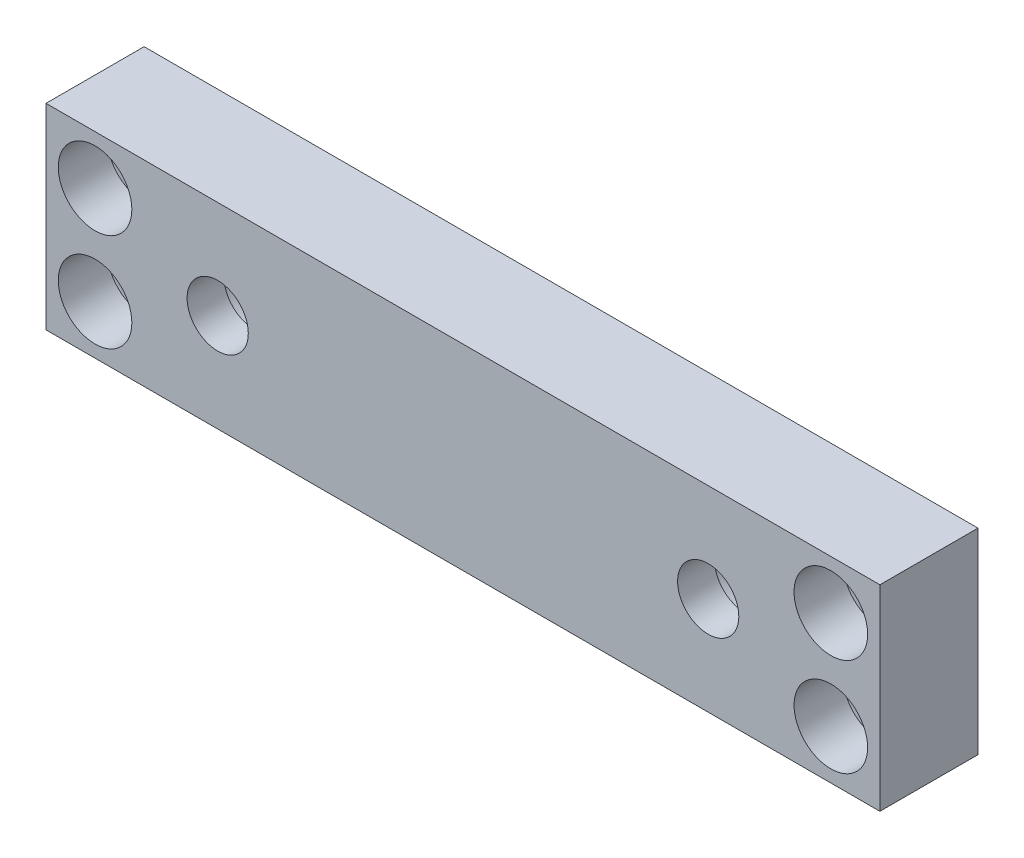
ISO-10303-21;
HEADER;
FILE_DESCRIPTION(('STEP AP214'),'2;1');
FILE_NAME('part.step','',(''),(''),'','','');
FILE_SCHEMA(('AUTOMOTIVE_DESIGN { 1 0 10303 214 1 1 1 1 }'));
ENDSEC;
DATA;
#1=APPLICATION_CONTEXT('core data for automotive mechanical design processes');
#2=APPLICATION_PROTOCOL_DEFINITION('international standard','automotive_design',2000,#1);
#3=PRODUCT_CONTEXT('',#1,'mechanical');
#4=PRODUCT('Part','Part','',(#3));
#5=PRODUCT_RELATED_PRODUCT_CATEGORY('part','',(#4));
#6=PRODUCT_DEFINITION_FORMATION('','',#4);
#7=PRODUCT_DEFINITION_CONTEXT('part definition',#1,'design');
#8=PRODUCT_DEFINITION('design','',#6,#7);
#9=PRODUCT_DEFINITION_SHAPE('','',#8);
#10=(LENGTH_UNIT() NAMED_UNIT(*) SI_UNIT(.MILLI.,.METRE.));
#11=(NAMED_UNIT(*) PLANE_ANGLE_UNIT() SI_UNIT($,.RADIAN.));
#12=(NAMED_UNIT(*) SI_UNIT($,.STERADIAN.) SOLID_ANGLE_UNIT());
#13=UNCERTAINTY_MEASURE_WITH_UNIT(LENGTH_MEASURE(1.E-05),#10,'distance_accuracy_value','');
#14=(GEOMETRIC_REPRESENTATION_CONTEXT(3) GLOBAL_UNCERTAINTY_ASSIGNED_CONTEXT((#13)) GLOBAL_UNIT_ASSIGNED_CONTEXT((#10,
#11,#12)) REPRESENTATION_CONTEXT('',''));
#15=CARTESIAN_POINT('',(0.,0.,0.));
#16=DIRECTION('',(0.,0.,1.));
#17=DIRECTION('',(1.,0.,0.));
#18=AXIS2_PLACEMENT_3D('',#15,#16,#17);
#19=CARTESIAN_POINT('',(0.,0.,12.7));
#20=DIRECTION('',(0.,0.,1.));
#21=DIRECTION('',(1.,0.,0.));
#22=AXIS2_PLACEMENT_3D('',#19,#20,#21);
#23=PLANE('',#22);
#24=CARTESIAN_POINT('',(47.625,-6.35,12.7));
#25=DIRECTION('',(0.,0.,1.));
#26=DIRECTION('',(1.,0.,0.));
#27=AXIS2_PLACEMENT_3D('',#24,#25,#26);
#28=CIRCLE('',#27,4.7625);
#29=CARTESIAN_POINT('',(52.3875,-6.35,12.7));
#30=VERTEX_POINT('',#29);
#31=EDGE_CURVE('E136',#30,#30,#28,.F.);
#32=ORIENTED_EDGE('',*,*,#31,.T.);
#33=EDGE_LOOP('',(#32));
#34=FACE_BOUND('',#33,.T.);
#35=CARTESIAN_POINT('',(-47.625,-6.35,12.7));
#36=DIRECTION('',(0.,0.,1.));
#37=DIRECTION('',(1.,0.,0.));
#38=AXIS2_PLACEMENT_3D('',#35,#36,#37);
#39=CIRCLE('',#38,4.7625);
#40=CARTESIAN_POINT('',(-42.8625,-6.35,12.7));
#41=VERTEX_POINT('',#40);
#42=EDGE_CURVE('E121',#41,#41,#39,.F.);
#43=ORIENTED_EDGE('',*,*,#42,.T.);
#44=EDGE_LOOP('',(#43));
#45=FACE_BOUND('',#44,.T.);
#46=CARTESIAN_POINT('',(-31.75,0.,12.7));
#47=DIRECTION('',(0.,0.,1.));
#48=DIRECTION('',(1.,0.,0.));
#49=AXIS2_PLACEMENT_3D('',#46,#47,#48);
#50=CIRCLE('',#49,3.9624);
#51=CARTESIAN_POINT('',(-27.7876,0.,12.7));
#52=VERTEX_POINT('',#51);
#53=EDGE_CURVE('E102',#52,#52,#50,.T.);
#54=ORIENTED_EDGE('',*,*,#53,.F.);
#55=EDGE_LOOP('',(#54));
#56=FACE_BOUND('',#55,.T.);
#57=DIRECTION('',(0.,-1.,0.));
#58=VECTOR('',#57,1.);
#59=CARTESIAN_POINT('',(-53.975,12.7,12.7));
#60=LINE('',#59,#58);
#61=CARTESIAN_POINT('',(-53.975,12.7,12.7));
#62=VERTEX_POINT('',#61);
#63=CARTESIAN_POINT('',(-53.975,-12.7,12.7));
#64=VERTEX_POINT('',#63);
#65=EDGE_CURVE('E86',#62,#64,#60,.T.);
#66=ORIENTED_EDGE('',*,*,#65,.T.);
#67=DIRECTION('',(1.,0.,0.));
#68=VECTOR('',#67,1.);
#69=CARTESIAN_POINT('',(-53.975,-12.7,12.7));
#70=LINE('',#69,#68);
#71=CARTESIAN_POINT('',(53.975,-12.7,12.7));
#72=VERTEX_POINT('',#71);
#73=EDGE_CURVE('E81',#64,#72,#70,.T.);
#74=ORIENTED_EDGE('',*,*,#73,.T.);
#75=DIRECTION('',(0.,1.,0.));
#76=VECTOR('',#75,1.);
#77=CARTESIAN_POINT('',(53.975,-12.7,12.7));
#78=LINE('',#77,#76);
#79=CARTESIAN_POINT('',(53.975,12.7,12.7));
#80=VERTEX_POINT('',#79);
#81=EDGE_CURVE('E84',#72,#80,#78,.T.);
#82=ORIENTED_EDGE('',*,*,#81,.T.);
#83=DIRECTION('',(-1.,0.,0.));
#84=VECTOR('',#83,1.);
#85=CARTESIAN_POINT('',(53.975,12.7,12.7));
#86=LINE('',#85,#84);
#87=EDGE_CURVE('E51',#80,#62,#86,.T.);
#88=ORIENTED_EDGE('',*,*,#87,.T.);
#89=EDGE_LOOP('',(#66,#74,#82,#88));
#90=FACE_BOUND('',#89,.T.);
#91=CARTESIAN_POINT('',(31.75,0.,12.7));
#92=DIRECTION('',(0.,0.,1.));
#93=DIRECTION('',(1.,0.,0.));
#94=AXIS2_PLACEMENT_3D('',#91,#92,#93);
#95=CIRCLE('',#94,3.9624);
#96=CARTESIAN_POINT('',(35.7124,0.,12.7));
#97=VERTEX_POINT('',#96);
#98=EDGE_CURVE('E169',#97,#97,#95,.T.);
#99=ORIENTED_EDGE('',*,*,#98,.F.);
#100=EDGE_LOOP('',(#99));
#101=FACE_BOUND('',#100,.T.);
#102=CARTESIAN_POINT('',(-47.625,6.35,12.7));
#103=DIRECTION('',(0.,0.,1.));
#104=DIRECTION('',(1.,0.,0.));
#105=AXIS2_PLACEMENT_3D('',#102,#103,#104);
#106=CIRCLE('',#105,4.7625);
#107=CARTESIAN_POINT('',(-42.8625,6.35,12.7));
#108=VERTEX_POINT('',#107);
#109=EDGE_CURVE('E129',#108,#108,#106,.F.);
#110=ORIENTED_EDGE('',*,*,#109,.T.);
#111=EDGE_LOOP('',(#110));
#112=FACE_BOUND('',#111,.T.);
#113=CARTESIAN_POINT('',(47.625,6.35,12.7));
#114=DIRECTION('',(0.,0.,1.));
#115=DIRECTION('',(1.,0.,0.));
#116=AXIS2_PLACEMENT_3D('',#113,#114,#115);
#117=CIRCLE('',#116,4.7625);
#118=CARTESIAN_POINT('',(52.3875,6.35,12.7));
#119=VERTEX_POINT('',#118);
#120=EDGE_CURVE('E36',#119,#119,#117,.F.);
#121=ORIENTED_EDGE('',*,*,#120,.T.);
#122=EDGE_LOOP('',(#121));
#123=FACE_BOUND('',#122,.T.);
#124=ADVANCED_FACE('F32',(#34,#45,#56,#90,#101,#112,#123),#23,.T.);
#125=CARTESIAN_POINT('',(47.625,6.35,12.7));
#126=DIRECTION('',(0.,0.,-1.));
#127=DIRECTION('',(-1.,0.,0.));
#128=AXIS2_PLACEMENT_3D('',#125,#126,#127);
#129=CYLINDRICAL_SURFACE('',#128,3.175);
#130=CARTESIAN_POINT('',(47.625,6.35,0.));
#131=DIRECTION('',(0.,0.,1.));
#132=DIRECTION('',(1.,0.,0.));
#133=AXIS2_PLACEMENT_3D('',#130,#131,#132);
#134=CIRCLE('',#133,3.175);
#135=CARTESIAN_POINT('',(50.8,6.35,0.));
#136=VERTEX_POINT('',#135);
#137=EDGE_CURVE('E166',#136,#136,#134,.T.);
#138=ORIENTED_EDGE('',*,*,#137,.F.);
#139=EDGE_LOOP('',(#138));
#140=FACE_BOUND('',#139,.T.);
#141=CARTESIAN_POINT('',(47.625,6.35,6.35));
#142=DIRECTION('',(0.,0.,1.));
#143=DIRECTION('',(1.,0.,0.));
#144=AXIS2_PLACEMENT_3D('',#141,#142,#143);
#145=CIRCLE('',#144,3.175);
#146=CARTESIAN_POINT('',(50.8,6.35,6.35));
#147=VERTEX_POINT('',#146);
#148=EDGE_CURVE('E139',#147,#147,#145,.T.);
#149=ORIENTED_EDGE('',*,*,#148,.T.);
#150=EDGE_LOOP('',(#149));
#151=FACE_BOUND('',#150,.T.);
#152=ADVANCED_FACE('F184',(#140,#151),#129,.F.);
#153=CARTESIAN_POINT('',(47.625,-6.35,12.7));
#154=DIRECTION('',(0.,0.,-1.));
#155=DIRECTION('',(-1.,0.,0.));
#156=AXIS2_PLACEMENT_3D('',#153,#154,#155);
#157=CYLINDRICAL_SURFACE('',#156,3.175);
#158=CARTESIAN_POINT('',(47.625,-6.35,0.));
#159=DIRECTION('',(0.,0.,1.));
#160=DIRECTION('',(1.,0.,0.));
#161=AXIS2_PLACEMENT_3D('',#158,#159,#160);
#162=CIRCLE('',#161,3.175);
#163=CARTESIAN_POINT('',(50.8,-6.35,0.));
#164=VERTEX_POINT('',#163);
#165=EDGE_CURVE('E111',#164,#164,#162,.T.);
#166=ORIENTED_EDGE('',*,*,#165,.F.);
#167=EDGE_LOOP('',(#166));
#168=FACE_BOUND('',#167,.T.);
#169=CARTESIAN_POINT('',(47.625,-6.35,6.35));
#170=DIRECTION('',(0.,0.,1.));
#171=DIRECTION('',(1.,0.,0.));
#172=AXIS2_PLACEMENT_3D('',#169,#170,#171);
#173=CIRCLE('',#172,3.175);
#174=CARTESIAN_POINT('',(50.8,-6.35,6.35));
#175=VERTEX_POINT('',#174);
#176=EDGE_CURVE('E133',#175,#175,#173,.T.);
#177=ORIENTED_EDGE('',*,*,#176,.T.);
#178=EDGE_LOOP('',(#177));
#179=FACE_BOUND('',#178,.T.);
#180=ADVANCED_FACE('F190',(#168,#179),#157,.F.);
#181=CARTESIAN_POINT('',(-47.625,6.35,12.7));
#182=DIRECTION('',(0.,0.,-1.));
#183=DIRECTION('',(-1.,0.,0.));
#184=AXIS2_PLACEMENT_3D('',#181,#182,#183);
#185=CYLINDRICAL_SURFACE('',#184,3.175);
#186=CARTESIAN_POINT('',(-47.625,6.35,0.));
#187=DIRECTION('',(0.,0.,1.));
#188=DIRECTION('',(1.,0.,0.));
#189=AXIS2_PLACEMENT_3D('',#186,#187,#188);
#190=CIRCLE('',#189,3.175);
#191=CARTESIAN_POINT('',(-44.45,6.35,0.));
#192=VERTEX_POINT('',#191);
#193=EDGE_CURVE('E172',#192,#192,#190,.T.);
#194=ORIENTED_EDGE('',*,*,#193,.F.);
#195=EDGE_LOOP('',(#194));
#196=FACE_BOUND('',#195,.T.);
#197=CARTESIAN_POINT('',(-47.625,6.35,6.35));
#198=DIRECTION('',(0.,0.,1.));
#199=DIRECTION('',(1.,0.,0.));
#200=AXIS2_PLACEMENT_3D('',#197,#198,#199);
#201=CIRCLE('',#200,3.175);
#202=CARTESIAN_POINT('',(-44.45,6.35,6.35));
#203=VERTEX_POINT('',#202);
#204=EDGE_CURVE('E126',#203,#203,#201,.T.);
#205=ORIENTED_EDGE('',*,*,#204,.T.);
#206=EDGE_LOOP('',(#205));
#207=FACE_BOUND('',#206,.T.);
#208=ADVANCED_FACE('F245',(#196,#207),#185,.F.);
#209=CARTESIAN_POINT('',(-47.625,-6.35,12.7));
#210=DIRECTION('',(0.,0.,-1.));
#211=DIRECTION('',(-1.,0.,0.));
#212=AXIS2_PLACEMENT_3D('',#209,#210,#211);
#213=CYLINDRICAL_SURFACE('',#212,3.175);
#214=CARTESIAN_POINT('',(-47.625,-6.35,0.));
#215=DIRECTION('',(0.,0.,1.));
#216=DIRECTION('',(1.,0.,0.));
#217=AXIS2_PLACEMENT_3D('',#214,#215,#216);
#218=CIRCLE('',#217,3.175);
#219=CARTESIAN_POINT('',(-44.45,-6.35,0.));
#220=VERTEX_POINT('',#219);
#221=EDGE_CURVE('E175',#220,#220,#218,.T.);
#222=ORIENTED_EDGE('',*,*,#221,.F.);
#223=EDGE_LOOP('',(#222));
#224=FACE_BOUND('',#223,.T.);
#225=CARTESIAN_POINT('',(-47.625,-6.35,6.35));
#226=DIRECTION('',(0.,0.,1.));
#227=DIRECTION('',(1.,0.,0.));
#228=AXIS2_PLACEMENT_3D('',#225,#226,#227);
#229=CIRCLE('',#228,3.175);
#230=CARTESIAN_POINT('',(-44.45,-6.35,6.35));
#231=VERTEX_POINT('',#230);
#232=EDGE_CURVE('E118',#231,#231,#229,.T.);
#233=ORIENTED_EDGE('',*,*,#232,.T.);
#234=EDGE_LOOP('',(#233));
#235=FACE_BOUND('',#234,.T.);
#236=ADVANCED_FACE('F200',(#224,#235),#213,.F.);
#237=CARTESIAN_POINT('',(0.,0.,0.));
#238=DIRECTION('',(0.,0.,1.));
#239=DIRECTION('',(1.,0.,0.));
#240=AXIS2_PLACEMENT_3D('',#237,#238,#239);
#241=PLANE('',#240);
#242=CARTESIAN_POINT('',(31.75,0.,0.));
#243=DIRECTION('',(0.,0.,1.));
#244=DIRECTION('',(1.,0.,0.));
#245=AXIS2_PLACEMENT_3D('',#242,#243,#244);
#246=CIRCLE('',#245,6.);
#247=CARTESIAN_POINT('',(37.75,0.,0.));
#248=VERTEX_POINT('',#247);
#249=EDGE_CURVE('E116',#248,#248,#246,.T.);
#250=ORIENTED_EDGE('',*,*,#249,.T.);
#251=EDGE_LOOP('',(#250));
#252=FACE_BOUND('',#251,.T.);
#253=ORIENTED_EDGE('',*,*,#137,.T.);
#254=EDGE_LOOP('',(#253));
#255=FACE_BOUND('',#254,.T.);
#256=ORIENTED_EDGE('',*,*,#193,.T.);
#257=EDGE_LOOP('',(#256));
#258=FACE_BOUND('',#257,.T.);
#259=DIRECTION('',(0.,-1.,0.));
#260=VECTOR('',#259,1.);
#261=CARTESIAN_POINT('',(-53.975,12.7,0.));
#262=LINE('',#261,#260);
#263=CARTESIAN_POINT('',(-53.975,12.7,0.));
#264=VERTEX_POINT('',#263);
#265=CARTESIAN_POINT('',(-53.975,-12.7,0.));
#266=VERTEX_POINT('',#265);
#267=EDGE_CURVE('E99',#264,#266,#262,.T.);
#268=ORIENTED_EDGE('',*,*,#267,.F.);
#269=DIRECTION('',(-1.,0.,0.));
#270=VECTOR('',#269,1.);
#271=CARTESIAN_POINT('',(53.975,12.7,0.));
#272=LINE('',#271,#270);
#273=CARTESIAN_POINT('',(53.975,12.7,0.));
#274=VERTEX_POINT('',#273);
#275=EDGE_CURVE('E74',#274,#264,#272,.T.);
#276=ORIENTED_EDGE('',*,*,#275,.F.);
#277=DIRECTION('',(0.,1.,0.));
#278=VECTOR('',#277,1.);
#279=CARTESIAN_POINT('',(53.975,-12.7,0.));
#280=LINE('',#279,#278);
#281=CARTESIAN_POINT('',(53.975,-12.7,0.));
#282=VERTEX_POINT('',#281);
#283=EDGE_CURVE('E68',#282,#274,#280,.T.);
#284=ORIENTED_EDGE('',*,*,#283,.F.);
#285=DIRECTION('',(1.,0.,0.));
#286=VECTOR('',#285,1.);
#287=CARTESIAN_POINT('',(-53.975,-12.7,0.));
#288=LINE('',#287,#286);
#289=EDGE_CURVE('E90',#266,#282,#288,.T.);
#290=ORIENTED_EDGE('',*,*,#289,.F.);
#291=EDGE_LOOP('',(#268,#276,#284,#290));
#292=FACE_BOUND('',#291,.T.);
#293=ORIENTED_EDGE('',*,*,#221,.T.);
#294=EDGE_LOOP('',(#293));
#295=FACE_BOUND('',#294,.T.);
#296=ORIENTED_EDGE('',*,*,#165,.T.);
#297=EDGE_LOOP('',(#296));
#298=FACE_BOUND('',#297,.T.);
#299=CARTESIAN_POINT('',(-31.75,0.,0.));
#300=DIRECTION('',(0.,0.,1.));
#301=DIRECTION('',(1.,0.,0.));
#302=AXIS2_PLACEMENT_3D('',#299,#300,#301);
#303=CIRCLE('',#302,6.);
#304=CARTESIAN_POINT('',(-25.75,0.,0.));
#305=VERTEX_POINT('',#304);
#306=EDGE_CURVE('E125',#305,#305,#303,.T.);
#307=ORIENTED_EDGE('',*,*,#306,.T.);
#308=EDGE_LOOP('',(#307));
#309=FACE_BOUND('',#308,.T.);
#310=ADVANCED_FACE('F197',(#252,#255,#258,#292,#295,#298,#309),#241,.F.);
#311=CARTESIAN_POINT('',(-53.975,12.7,12.7));
#312=DIRECTION('',(1.,0.,0.));
#313=DIRECTION('',(0.,0.,-1.));
#314=AXIS2_PLACEMENT_3D('',#311,#312,#313);
#315=PLANE('',#314);
#316=ORIENTED_EDGE('',*,*,#267,.T.);
#317=DIRECTION('',(0.,0.,-1.));
#318=VECTOR('',#317,1.);
#319=CARTESIAN_POINT('',(-53.975,-12.7,12.7));
#320=LINE('',#319,#318);
#321=EDGE_CURVE('E11',#64,#266,#320,.T.);
#322=ORIENTED_EDGE('',*,*,#321,.F.);
#323=ORIENTED_EDGE('',*,*,#65,.F.);
#324=DIRECTION('',(0.,0.,-1.));
#325=VECTOR('',#324,1.);
#326=CARTESIAN_POINT('',(-53.975,12.7,12.7));
#327=LINE('',#326,#325);
#328=EDGE_CURVE('E95',#62,#264,#327,.T.);
#329=ORIENTED_EDGE('',*,*,#328,.T.);
#330=EDGE_LOOP('',(#316,#322,#323,#329));
#331=FACE_BOUND('',#330,.T.);
#332=ADVANCED_FACE('F34',(#331),#315,.F.);
#333=CARTESIAN_POINT('',(-53.975,-12.7,12.7));
#334=DIRECTION('',(0.,1.,0.));
#335=DIRECTION('',(0.,0.,1.));
#336=AXIS2_PLACEMENT_3D('',#333,#334,#335);
#337=PLANE('',#336);
#338=ORIENTED_EDGE('',*,*,#289,.T.);
#339=DIRECTION('',(0.,0.,-1.));
#340=VECTOR('',#339,1.);
#341=CARTESIAN_POINT('',(53.975,-12.7,12.7));
#342=LINE('',#341,#340);
#343=EDGE_CURVE('E42',#72,#282,#342,.T.);
#344=ORIENTED_EDGE('',*,*,#343,.F.);
#345=ORIENTED_EDGE('',*,*,#73,.F.);
#346=ORIENTED_EDGE('',*,*,#321,.T.);
#347=EDGE_LOOP('',(#338,#344,#345,#346));
#348=FACE_BOUND('',#347,.T.);
#349=ADVANCED_FACE('F89',(#348),#337,.F.);
#350=CARTESIAN_POINT('',(53.975,-12.7,12.7));
#351=DIRECTION('',(-1.,0.,0.));
#352=DIRECTION('',(0.,0.,1.));
#353=AXIS2_PLACEMENT_3D('',#350,#351,#352);
#354=PLANE('',#353);
#355=ORIENTED_EDGE('',*,*,#283,.T.);
#356=DIRECTION('',(0.,0.,-1.));
#357=VECTOR('',#356,1.);
#358=CARTESIAN_POINT('',(53.975,12.7,12.7));
#359=LINE('',#358,#357);
#360=EDGE_CURVE('E91',#80,#274,#359,.T.);
#361=ORIENTED_EDGE('',*,*,#360,.F.);
#362=ORIENTED_EDGE('',*,*,#81,.F.);
#363=ORIENTED_EDGE('',*,*,#343,.T.);
#364=EDGE_LOOP('',(#355,#361,#362,#363));
#365=FACE_BOUND('',#364,.T.);
#366=ADVANCED_FACE('F93',(#365),#354,.F.);
#367=CARTESIAN_POINT('',(53.975,12.7,12.7));
#368=DIRECTION('',(0.,-1.,0.));
#369=DIRECTION('',(0.,0.,-1.));
#370=AXIS2_PLACEMENT_3D('',#367,#368,#369);
#371=PLANE('',#370);
#372=ORIENTED_EDGE('',*,*,#275,.T.);
#373=ORIENTED_EDGE('',*,*,#328,.F.);
#374=ORIENTED_EDGE('',*,*,#87,.F.);
#375=ORIENTED_EDGE('',*,*,#360,.T.);
#376=EDGE_LOOP('',(#372,#373,#374,#375));
#377=FACE_BOUND('',#376,.T.);
#378=ADVANCED_FACE('F202',(#377),#371,.F.);
#379=CARTESIAN_POINT('',(-31.75,0.,12.7));
#380=DIRECTION('',(0.,0.,-1.));
#381=DIRECTION('',(-1.,0.,0.));
#382=AXIS2_PLACEMENT_3D('',#379,#380,#381);
#383=CYLINDRICAL_SURFACE('',#382,3.9624);
#384=CARTESIAN_POINT('',(-31.75,0.,7.9248));
#385=DIRECTION('',(0.,0.,1.));
#386=DIRECTION('',(1.,0.,0.));
#387=AXIS2_PLACEMENT_3D('',#384,#385,#386);
#388=CIRCLE('',#387,3.9624);
#389=CARTESIAN_POINT('',(-27.7876,0.,7.9248));
#390=VERTEX_POINT('',#389);
#391=EDGE_CURVE('E113',#390,#390,#388,.T.);
#392=ORIENTED_EDGE('',*,*,#391,.F.);
#393=EDGE_LOOP('',(#392));
#394=FACE_BOUND('',#393,.T.);
#395=ORIENTED_EDGE('',*,*,#53,.T.);
#396=EDGE_LOOP('',(#395));
#397=FACE_BOUND('',#396,.T.);
#398=ADVANCED_FACE('F181',(#394,#397),#383,.F.);
#399=CARTESIAN_POINT('',(31.75,0.,12.7));
#400=DIRECTION('',(0.,0.,-1.));
#401=DIRECTION('',(-1.,0.,0.));
#402=AXIS2_PLACEMENT_3D('',#399,#400,#401);
#403=CYLINDRICAL_SURFACE('',#402,3.9624);
#404=CARTESIAN_POINT('',(31.75,0.,7.9248));
#405=DIRECTION('',(0.,0.,1.));
#406=DIRECTION('',(1.,0.,0.));
#407=AXIS2_PLACEMENT_3D('',#404,#405,#406);
#408=CIRCLE('',#407,3.9624);
#409=CARTESIAN_POINT('',(35.7124,0.,7.9248));
#410=VERTEX_POINT('',#409);
#411=EDGE_CURVE('E108',#410,#410,#408,.T.);
#412=ORIENTED_EDGE('',*,*,#411,.F.);
#413=EDGE_LOOP('',(#412));
#414=FACE_BOUND('',#413,.T.);
#415=ORIENTED_EDGE('',*,*,#98,.T.);
#416=EDGE_LOOP('',(#415));
#417=FACE_BOUND('',#416,.T.);
#418=ADVANCED_FACE('F242',(#414,#417),#403,.F.);
#419=CARTESIAN_POINT('',(31.75,0.,7.9248));
#420=DIRECTION('',(0.,0.,-1.));
#421=DIRECTION('',(-1.,0.,0.));
#422=AXIS2_PLACEMENT_3D('',#419,#420,#421);
#423=CYLINDRICAL_SURFACE('',#422,6.);
#424=CARTESIAN_POINT('',(31.75,0.,7.9248));
#425=DIRECTION('',(0.,0.,1.));
#426=DIRECTION('',(1.,0.,0.));
#427=AXIS2_PLACEMENT_3D('',#424,#425,#426);
#428=CIRCLE('',#427,6.);
#429=CARTESIAN_POINT('',(37.75,0.,7.9248));
#430=VERTEX_POINT('',#429);
#431=EDGE_CURVE('E112',#430,#430,#428,.T.);
#432=ORIENTED_EDGE('',*,*,#431,.T.);
#433=EDGE_LOOP('',(#432));
#434=FACE_BOUND('',#433,.T.);
#435=ORIENTED_EDGE('',*,*,#249,.F.);
#436=EDGE_LOOP('',(#435));
#437=FACE_BOUND('',#436,.T.);
#438=ADVANCED_FACE('F235',(#434,#437),#423,.F.);
#439=CARTESIAN_POINT('',(31.75,0.,7.9248));
#440=DIRECTION('',(0.,0.,1.));
#441=DIRECTION('',(1.,0.,0.));
#442=AXIS2_PLACEMENT_3D('',#439,#440,#441);
#443=PLANE('',#442);
#444=ORIENTED_EDGE('',*,*,#411,.T.);
#445=EDGE_LOOP('',(#444));
#446=FACE_BOUND('',#445,.T.);
#447=ORIENTED_EDGE('',*,*,#431,.F.);
#448=EDGE_LOOP('',(#447));
#449=FACE_BOUND('',#448,.T.);
#450=ADVANCED_FACE('F225',(#446,#449),#443,.F.);
#451=CARTESIAN_POINT('',(-31.75,0.,7.9248));
#452=DIRECTION('',(0.,0.,-1.));
#453=DIRECTION('',(-1.,0.,0.));
#454=AXIS2_PLACEMENT_3D('',#451,#452,#453);
#455=CYLINDRICAL_SURFACE('',#454,6.);
#456=CARTESIAN_POINT('',(-31.75,0.,7.9248));
#457=DIRECTION('',(0.,0.,1.));
#458=DIRECTION('',(1.,0.,0.));
#459=AXIS2_PLACEMENT_3D('',#456,#457,#458);
#460=CIRCLE('',#459,6.);
#461=CARTESIAN_POINT('',(-25.75,0.,7.9248));
#462=VERTEX_POINT('',#461);
#463=EDGE_CURVE('E117',#462,#462,#460,.T.);
#464=ORIENTED_EDGE('',*,*,#463,.T.);
#465=EDGE_LOOP('',(#464));
#466=FACE_BOUND('',#465,.T.);
#467=ORIENTED_EDGE('',*,*,#306,.F.);
#468=EDGE_LOOP('',(#467));
#469=FACE_BOUND('',#468,.T.);
#470=ADVANCED_FACE('F222',(#466,#469),#455,.F.);
#471=CARTESIAN_POINT('',(-31.75,0.,7.9248));
#472=DIRECTION('',(0.,0.,1.));
#473=DIRECTION('',(1.,0.,0.));
#474=AXIS2_PLACEMENT_3D('',#471,#472,#473);
#475=PLANE('',#474);
#476=ORIENTED_EDGE('',*,*,#391,.T.);
#477=EDGE_LOOP('',(#476));
#478=FACE_BOUND('',#477,.T.);
#479=ORIENTED_EDGE('',*,*,#463,.F.);
#480=EDGE_LOOP('',(#479));
#481=FACE_BOUND('',#480,.T.);
#482=ADVANCED_FACE('F224',(#478,#481),#475,.F.);
#483=CARTESIAN_POINT('',(-47.625,-6.35,31.75));
#484=DIRECTION('',(0.,0.,-1.));
#485=DIRECTION('',(-1.,0.,0.));
#486=AXIS2_PLACEMENT_3D('',#483,#484,#485);
#487=CYLINDRICAL_SURFACE('',#486,4.7625);
#488=ORIENTED_EDGE('',*,*,#42,.F.);
#489=EDGE_LOOP('',(#488));
#490=FACE_BOUND('',#489,.T.);
#491=CARTESIAN_POINT('',(-47.625,-6.35,6.35));
#492=DIRECTION('',(0.,0.,1.));
#493=DIRECTION('',(1.,0.,0.));
#494=AXIS2_PLACEMENT_3D('',#491,#492,#493);
#495=CIRCLE('',#494,4.7625);
#496=CARTESIAN_POINT('',(-42.8625,-6.35,6.35));
#497=VERTEX_POINT('',#496);
#498=EDGE_CURVE('E122',#497,#497,#495,.T.);
#499=ORIENTED_EDGE('',*,*,#498,.F.);
#500=EDGE_LOOP('',(#499));
#501=FACE_BOUND('',#500,.T.);
#502=ADVANCED_FACE('F232',(#490,#501),#487,.F.);
#503=CARTESIAN_POINT('',(-47.625,-6.35,6.35));
#504=DIRECTION('',(0.,0.,1.));
#505=DIRECTION('',(1.,0.,0.));
#506=AXIS2_PLACEMENT_3D('',#503,#504,#505);
#507=PLANE('',#506);
#508=ORIENTED_EDGE('',*,*,#232,.F.);
#509=EDGE_LOOP('',(#508));
#510=FACE_BOUND('',#509,.T.);
#511=ORIENTED_EDGE('',*,*,#498,.T.);
#512=EDGE_LOOP('',(#511));
#513=FACE_BOUND('',#512,.T.);
#514=ADVANCED_FACE('F260',(#510,#513),#507,.T.);
#515=CARTESIAN_POINT('',(-47.625,6.35,31.75));
#516=DIRECTION('',(0.,0.,-1.));
#517=DIRECTION('',(-1.,0.,0.));
#518=AXIS2_PLACEMENT_3D('',#515,#516,#517);
#519=CYLINDRICAL_SURFACE('',#518,4.7625);
#520=ORIENTED_EDGE('',*,*,#109,.F.);
#521=EDGE_LOOP('',(#520));
#522=FACE_BOUND('',#521,.T.);
#523=CARTESIAN_POINT('',(-47.625,6.35,6.35));
#524=DIRECTION('',(0.,0.,1.));
#525=DIRECTION('',(1.,0.,0.));
#526=AXIS2_PLACEMENT_3D('',#523,#524,#525);
#527=CIRCLE('',#526,4.7625);
#528=CARTESIAN_POINT('',(-42.8625,6.35,6.35));
#529=VERTEX_POINT('',#528);
#530=EDGE_CURVE('E130',#529,#529,#527,.T.);
#531=ORIENTED_EDGE('',*,*,#530,.F.);
#532=EDGE_LOOP('',(#531));
#533=FACE_BOUND('',#532,.T.);
#534=ADVANCED_FACE('F263',(#522,#533),#519,.F.);
#535=CARTESIAN_POINT('',(-47.625,6.35,6.35));
#536=DIRECTION('',(0.,0.,1.));
#537=DIRECTION('',(1.,0.,0.));
#538=AXIS2_PLACEMENT_3D('',#535,#536,#537);
#539=PLANE('',#538);
#540=ORIENTED_EDGE('',*,*,#204,.F.);
#541=EDGE_LOOP('',(#540));
#542=FACE_BOUND('',#541,.T.);
#543=ORIENTED_EDGE('',*,*,#530,.T.);
#544=EDGE_LOOP('',(#543));
#545=FACE_BOUND('',#544,.T.);
#546=ADVANCED_FACE('F275',(#542,#545),#539,.T.);
#547=CARTESIAN_POINT('',(47.625,-6.35,31.75));
#548=DIRECTION('',(0.,0.,-1.));
#549=DIRECTION('',(-1.,0.,0.));
#550=AXIS2_PLACEMENT_3D('',#547,#548,#549);
#551=CYLINDRICAL_SURFACE('',#550,4.7625);
#552=ORIENTED_EDGE('',*,*,#31,.F.);
#553=EDGE_LOOP('',(#552));
#554=FACE_BOUND('',#553,.T.);
#555=CARTESIAN_POINT('',(47.625,-6.35,6.35));
#556=DIRECTION('',(0.,0.,1.));
#557=DIRECTION('',(1.,0.,0.));
#558=AXIS2_PLACEMENT_3D('',#555,#556,#557);
#559=CIRCLE('',#558,4.7625);
#560=CARTESIAN_POINT('',(52.3875,-6.35,6.35));
#561=VERTEX_POINT('',#560);
#562=EDGE_CURVE('E137',#561,#561,#559,.T.);
#563=ORIENTED_EDGE('',*,*,#562,.F.);
#564=EDGE_LOOP('',(#563));
#565=FACE_BOUND('',#564,.T.);
#566=ADVANCED_FACE('F279',(#554,#565),#551,.F.);
#567=CARTESIAN_POINT('',(47.625,-6.35,6.35));
#568=DIRECTION('',(0.,0.,1.));
#569=DIRECTION('',(1.,0.,0.));
#570=AXIS2_PLACEMENT_3D('',#567,#568,#569);
#571=PLANE('',#570);
#572=ORIENTED_EDGE('',*,*,#176,.F.);
#573=EDGE_LOOP('',(#572));
#574=FACE_BOUND('',#573,.T.);
#575=ORIENTED_EDGE('',*,*,#562,.T.);
#576=EDGE_LOOP('',(#575));
#577=FACE_BOUND('',#576,.T.);
#578=ADVANCED_FACE('F283',(#574,#577),#571,.T.);
#579=CARTESIAN_POINT('',(47.625,6.35,31.75));
#580=DIRECTION('',(0.,0.,-1.));
#581=DIRECTION('',(-1.,0.,0.));
#582=AXIS2_PLACEMENT_3D('',#579,#580,#581);
#583=CYLINDRICAL_SURFACE('',#582,4.7625);
#584=ORIENTED_EDGE('',*,*,#120,.F.);
#585=EDGE_LOOP('',(#584));
#586=FACE_BOUND('',#585,.T.);
#587=CARTESIAN_POINT('',(47.625,6.35,6.35));
#588=DIRECTION('',(0.,0.,1.));
#589=DIRECTION('',(1.,0.,0.));
#590=AXIS2_PLACEMENT_3D('',#587,#588,#589);
#591=CIRCLE('',#590,4.7625);
#592=CARTESIAN_POINT('',(52.3875,6.35,6.35));
#593=VERTEX_POINT('',#592);
#594=EDGE_CURVE('E141',#593,#593,#591,.T.);
#595=ORIENTED_EDGE('',*,*,#594,.F.);
#596=EDGE_LOOP('',(#595));
#597=FACE_BOUND('',#596,.T.);
#598=ADVANCED_FACE('F287',(#586,#597),#583,.F.);
#599=CARTESIAN_POINT('',(47.625,6.35,6.35));
#600=DIRECTION('',(0.,0.,1.));
#601=DIRECTION('',(1.,0.,0.));
#602=AXIS2_PLACEMENT_3D('',#599,#600,#601);
#603=PLANE('',#602);
#604=ORIENTED_EDGE('',*,*,#148,.F.);
#605=EDGE_LOOP('',(#604));
#606=FACE_BOUND('',#605,.T.);
#607=ORIENTED_EDGE('',*,*,#594,.T.);
#608=EDGE_LOOP('',(#607));
#609=FACE_BOUND('',#608,.T.);
#610=ADVANCED_FACE('F291',(#606,#609),#603,.T.);
#611=CLOSED_SHELL('',(#124,#152,#180,#208,#236,#310,#332,#349,#366,#378,#398,#418,#438,#450,
#470,#482,#502,#514,#534,#546,#566,#578,#598,#610));
#612=MANIFOLD_SOLID_BREP('B2',#611);
#613=ADVANCED_BREP_SHAPE_REPRESENTATION('',(#18,#612),#14);
#614=SHAPE_DEFINITION_REPRESENTATION(#9,#613);
ENDSEC;
END-ISO-10303-21;
